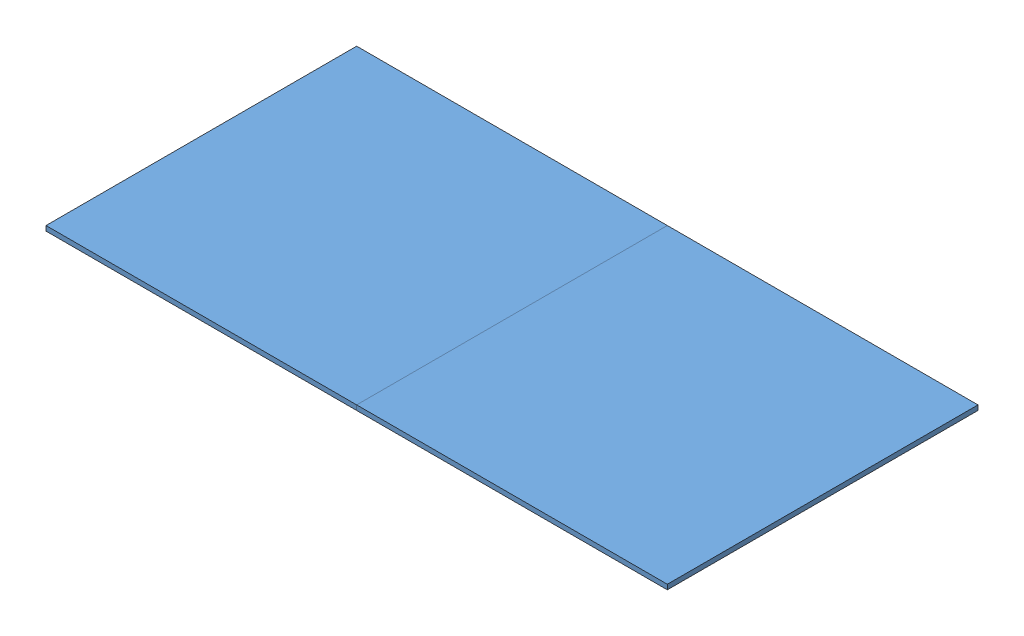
SolidWorks assembly 2 4x4 Particle Board.SLDASM, configuration Default (file format 16000). Lengths in mm.
Overall size (2438.4 19.05 1219.2).
2 component instances, 1 part files, 6 mates.
Components (placement in the parent):
- Particle board-1: Particle board.SLDPRT [Default] at (-609.6 0 609.6) size (1219.2 19.05 1219.2)
- Particle board-2: Particle board.SLDPRT [Default] at (609.6 0 609.6) size (1219.2 19.05 1219.2)
Mates (geometry in assembly coordinates):
- Coincident1: coincident anti-aligned: plane of Particle board-1 through (-1219.2 19.05 0) normal (0 0 -1)
- Coincident2: coincident aligned: plane of Particle board-1 through (0 19.05 1219.2) normal (1 0 0)
- Coincident3: coincident anti-aligned: plane of Particle board-1 through (-1219.2 0 0) normal (0 -1 0)
- Coincident4: coincident: plane of Particle board-1 through (0 19.05 1219.2) normal (1 0 0); plane of Particle board-2 through (0 19.05 1219.2) normal (-1 0 0)
- Coincident5: coincident: plane of Particle board-1 through (-1219.2 19.05 0) normal (0 0 -1); plane of Particle board-2 through (0 19.05 0) normal (0 0 -1)
- Coincident6: coincident aligned: plane of Particle board-1 through (-1219.2 0 0) normal (0 -1 0); plane of Particle board-2 through (0 0 0) normal (0 -1 0)
